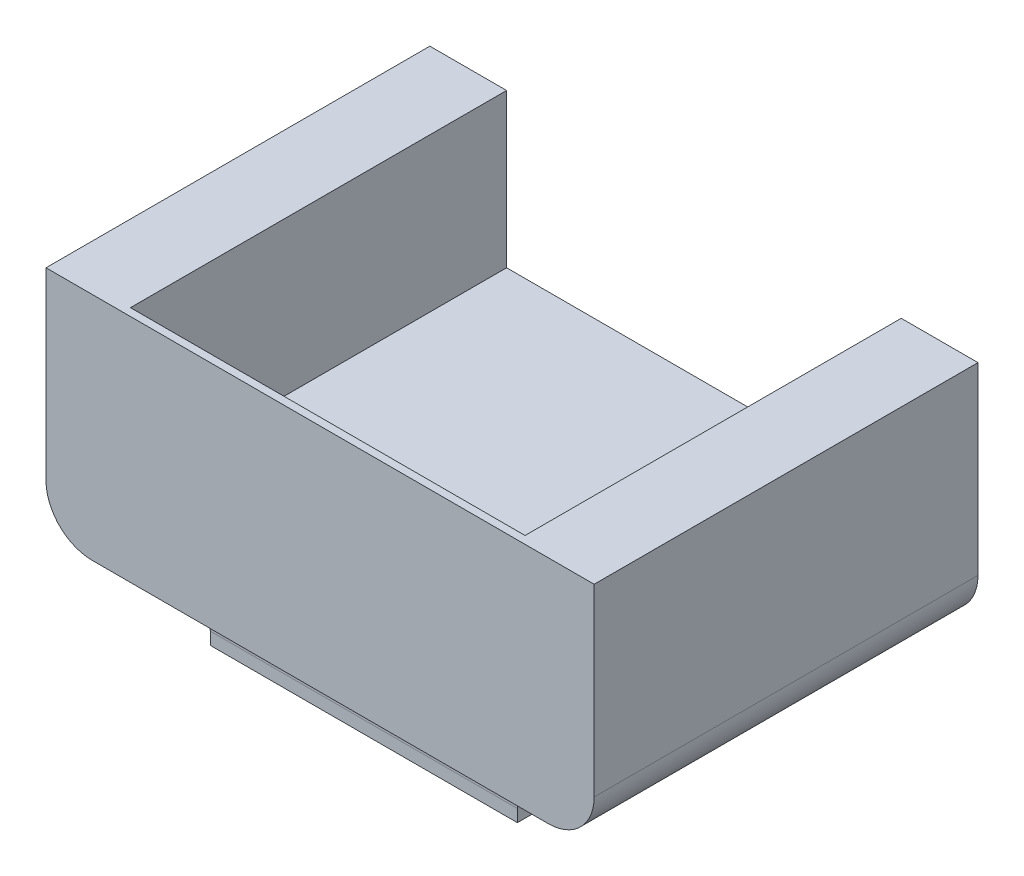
ISO-10303-21;
HEADER;
FILE_DESCRIPTION(('STEP AP214'),'2;1');
FILE_NAME('part.step','',(''),(''),'','','');
FILE_SCHEMA(('AUTOMOTIVE_DESIGN { 1 0 10303 214 1 1 1 1 }'));
ENDSEC;
DATA;
#1=APPLICATION_CONTEXT('core data for automotive mechanical design processes');
#2=APPLICATION_PROTOCOL_DEFINITION('international standard','automotive_design',2000,#1);
#3=PRODUCT_CONTEXT('',#1,'mechanical');
#4=PRODUCT('Part','Part','',(#3));
#5=PRODUCT_RELATED_PRODUCT_CATEGORY('part','',(#4));
#6=PRODUCT_DEFINITION_FORMATION('','',#4);
#7=PRODUCT_DEFINITION_CONTEXT('part definition',#1,'design');
#8=PRODUCT_DEFINITION('design','',#6,#7);
#9=PRODUCT_DEFINITION_SHAPE('','',#8);
#10=(LENGTH_UNIT() NAMED_UNIT(*) SI_UNIT(.MILLI.,.METRE.));
#11=(NAMED_UNIT(*) PLANE_ANGLE_UNIT() SI_UNIT($,.RADIAN.));
#12=(NAMED_UNIT(*) SI_UNIT($,.STERADIAN.) SOLID_ANGLE_UNIT());
#13=UNCERTAINTY_MEASURE_WITH_UNIT(LENGTH_MEASURE(1.E-05),#10,'distance_accuracy_value','');
#14=(GEOMETRIC_REPRESENTATION_CONTEXT(3) GLOBAL_UNCERTAINTY_ASSIGNED_CONTEXT((#13)) GLOBAL_UNIT_ASSIGNED_CONTEXT((#10,
#11,#12)) REPRESENTATION_CONTEXT('',''));
#15=CARTESIAN_POINT('',(0.,0.,0.));
#16=DIRECTION('',(0.,0.,1.));
#17=DIRECTION('',(1.,0.,0.));
#18=AXIS2_PLACEMENT_3D('',#15,#16,#17);
#19=CARTESIAN_POINT('',(17.8500000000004,62.3776420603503,-25.));
#20=DIRECTION('',(0.,-1.,0.));
#21=DIRECTION('',(1.,0.,0.));
#22=AXIS2_PLACEMENT_3D('',#19,#20,#21);
#23=PLANE('',#22);
#24=DIRECTION('',(-1.,0.,0.));
#25=VECTOR('',#24,1.);
#26=CARTESIAN_POINT('',(17.8500000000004,62.3776420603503,-19.9699999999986));
#27=LINE('',#26,#25);
#28=CARTESIAN_POINT('',(10.,62.3776420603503,-19.9699999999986));
#29=VERTEX_POINT('',#28);
#30=CARTESIAN_POINT('',(-10.,62.3776420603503,-19.9699999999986));
#31=VERTEX_POINT('',#30);
#32=EDGE_CURVE('E224',#29,#31,#27,.T.);
#33=ORIENTED_EDGE('',*,*,#32,.T.);
#34=DIRECTION('',(0.,0.,1.));
#35=VECTOR('',#34,1.);
#36=CARTESIAN_POINT('',(-10.,62.3776420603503,-16.9699999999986));
#37=LINE('',#36,#35);
#38=CARTESIAN_POINT('',(-10.,62.3776420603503,-14.9699999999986));
#39=VERTEX_POINT('',#38);
#40=EDGE_CURVE('E385',#31,#39,#37,.T.);
#41=ORIENTED_EDGE('',*,*,#40,.T.);
#42=DIRECTION('',(-1.,0.,0.));
#43=VECTOR('',#42,1.);
#44=CARTESIAN_POINT('',(10.,62.3776420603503,-14.9699999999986));
#45=LINE('',#44,#43);
#46=CARTESIAN_POINT('',(10.,62.3776420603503,-14.9699999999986));
#47=VERTEX_POINT('',#46);
#48=EDGE_CURVE('E375',#47,#39,#45,.T.);
#49=ORIENTED_EDGE('',*,*,#48,.F.);
#50=DIRECTION('',(0.,0.,1.));
#51=VECTOR('',#50,1.);
#52=CARTESIAN_POINT('',(10.,62.3776420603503,-16.9699999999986));
#53=LINE('',#52,#51);
#54=EDGE_CURVE('E395',#29,#47,#53,.T.);
#55=ORIENTED_EDGE('',*,*,#54,.F.);
#56=EDGE_LOOP('',(#33,#41,#49,#55));
#57=FACE_BOUND('',#56,.T.);
#58=DIRECTION('',(1.,0.,0.));
#59=VECTOR('',#58,1.);
#60=CARTESIAN_POINT('',(17.8500000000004,62.3776420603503,-25.));
#61=LINE('',#60,#59);
#62=CARTESIAN_POINT('',(-14.8499999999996,62.3776420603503,-25.));
#63=VERTEX_POINT('',#62);
#64=CARTESIAN_POINT('',(14.8500000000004,62.3776420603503,-25.));
#65=VERTEX_POINT('',#64);
#66=EDGE_CURVE('E286',#63,#65,#61,.T.);
#67=ORIENTED_EDGE('',*,*,#66,.T.);
#68=DIRECTION('',(0.,0.,1.));
#69=VECTOR('',#68,1.);
#70=CARTESIAN_POINT('',(14.8500000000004,62.3776420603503,-25.));
#71=LINE('',#70,#69);
#72=CARTESIAN_POINT('',(14.8500000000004,62.3776420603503,0.));
#73=VERTEX_POINT('',#72);
#74=EDGE_CURVE('E230',#65,#73,#71,.T.);
#75=ORIENTED_EDGE('',*,*,#74,.T.);
#76=DIRECTION('',(1.,0.,0.));
#77=VECTOR('',#76,1.);
#78=CARTESIAN_POINT('',(17.8500000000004,62.3776420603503,0.));
#79=LINE('',#78,#77);
#80=CARTESIAN_POINT('',(10.,62.3776420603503,0.));
#81=VERTEX_POINT('',#80);
#82=EDGE_CURVE('E275',#81,#73,#79,.T.);
#83=ORIENTED_EDGE('',*,*,#82,.F.);
#84=DIRECTION('',(0.,0.,1.));
#85=VECTOR('',#84,1.);
#86=CARTESIAN_POINT('',(10.,62.3776420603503,-4.84999999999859));
#87=LINE('',#86,#85);
#88=CARTESIAN_POINT('',(10.,62.3776420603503,-4.84999999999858));
#89=VERTEX_POINT('',#88);
#90=EDGE_CURVE('E366',#89,#81,#87,.T.);
#91=ORIENTED_EDGE('',*,*,#90,.F.);
#92=DIRECTION('',(-1.,0.,0.));
#93=VECTOR('',#92,1.);
#94=CARTESIAN_POINT('',(10.,62.3776420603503,-4.84999999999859));
#95=LINE('',#94,#93);
#96=CARTESIAN_POINT('',(-10.,62.3776420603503,-4.84999999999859));
#97=VERTEX_POINT('',#96);
#98=EDGE_CURVE('E349',#89,#97,#95,.T.);
#99=ORIENTED_EDGE('',*,*,#98,.T.);
#100=DIRECTION('',(0.,0.,1.));
#101=VECTOR('',#100,1.);
#102=CARTESIAN_POINT('',(-10.,62.3776420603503,-4.84999999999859));
#103=LINE('',#102,#101);
#104=CARTESIAN_POINT('',(-10.,62.3776420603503,0.));
#105=VERTEX_POINT('',#104);
#106=EDGE_CURVE('E260',#97,#105,#103,.T.);
#107=ORIENTED_EDGE('',*,*,#106,.T.);
#108=CARTESIAN_POINT('',(-14.8499999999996,62.3776420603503,0.));
#109=VERTEX_POINT('',#108);
#110=EDGE_CURVE('E265',#109,#105,#79,.T.);
#111=ORIENTED_EDGE('',*,*,#110,.F.);
#112=DIRECTION('',(0.,0.,1.));
#113=VECTOR('',#112,1.);
#114=CARTESIAN_POINT('',(-14.8499999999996,62.3776420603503,-25.));
#115=LINE('',#114,#113);
#116=EDGE_CURVE('E227',#109,#63,#115,.F.);
#117=ORIENTED_EDGE('',*,*,#116,.T.);
#118=EDGE_LOOP('',(#67,#75,#83,#91,#99,#107,#111,#117));
#119=FACE_BOUND('',#118,.T.);
#120=DIRECTION('',(0.,0.,1.));
#121=VECTOR('',#120,1.);
#122=CARTESIAN_POINT('',(10.,62.3776420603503,-13.6499999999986));
#123=LINE('',#122,#121);
#124=CARTESIAN_POINT('',(10.,62.3776420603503,-13.6499999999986));
#125=VERTEX_POINT('',#124);
#126=CARTESIAN_POINT('',(10.,62.3776420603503,-6.16999999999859));
#127=VERTEX_POINT('',#126);
#128=EDGE_CURVE('E327',#125,#127,#123,.T.);
#129=ORIENTED_EDGE('',*,*,#128,.F.);
#130=DIRECTION('',(-1.,0.,0.));
#131=VECTOR('',#130,1.);
#132=CARTESIAN_POINT('',(10.,62.3776420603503,-13.6499999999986));
#133=LINE('',#132,#131);
#134=CARTESIAN_POINT('',(-10.,62.3776420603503,-13.6499999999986));
#135=VERTEX_POINT('',#134);
#136=EDGE_CURVE('E321',#125,#135,#133,.T.);
#137=ORIENTED_EDGE('',*,*,#136,.T.);
#138=DIRECTION('',(0.,0.,1.));
#139=VECTOR('',#138,1.);
#140=CARTESIAN_POINT('',(-10.,62.3776420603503,-13.6499999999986));
#141=LINE('',#140,#139);
#142=CARTESIAN_POINT('',(-10.,62.3776420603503,-6.16999999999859));
#143=VERTEX_POINT('',#142);
#144=EDGE_CURVE('E328',#135,#143,#141,.T.);
#145=ORIENTED_EDGE('',*,*,#144,.T.);
#146=DIRECTION('',(-1.,0.,0.));
#147=VECTOR('',#146,1.);
#148=CARTESIAN_POINT('',(10.,62.3776420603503,-6.16999999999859));
#149=LINE('',#148,#147);
#150=EDGE_CURVE('E324',#127,#143,#149,.T.);
#151=ORIENTED_EDGE('',*,*,#150,.F.);
#152=EDGE_LOOP('',(#129,#137,#145,#151));
#153=FACE_BOUND('',#152,.T.);
#154=ADVANCED_FACE('F31',(#57,#119,#153),#23,.T.);
#155=CARTESIAN_POINT('',(-17.8499999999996,62.3776420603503,-25.));
#156=DIRECTION('',(-1.,0.,0.));
#157=DIRECTION('',(0.,-1.,0.));
#158=AXIS2_PLACEMENT_3D('',#155,#156,#157);
#159=PLANE('',#158);
#160=DIRECTION('',(0.,-1.,0.));
#161=VECTOR('',#160,1.);
#162=CARTESIAN_POINT('',(-17.8499999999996,62.3776420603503,-25.));
#163=LINE('',#162,#161);
#164=CARTESIAN_POINT('',(-17.8499999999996,77.3776420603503,-25.));
#165=VERTEX_POINT('',#164);
#166=CARTESIAN_POINT('',(-17.8499999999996,65.3776420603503,-25.));
#167=VERTEX_POINT('',#166);
#168=EDGE_CURVE('E223',#165,#167,#163,.T.);
#169=ORIENTED_EDGE('',*,*,#168,.T.);
#170=DIRECTION('',(0.,0.,1.));
#171=VECTOR('',#170,1.);
#172=CARTESIAN_POINT('',(-17.8499999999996,65.3776420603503,-25.));
#173=LINE('',#172,#171);
#174=CARTESIAN_POINT('',(-17.8499999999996,65.3776420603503,0.));
#175=VERTEX_POINT('',#174);
#176=EDGE_CURVE('E243',#167,#175,#173,.T.);
#177=ORIENTED_EDGE('',*,*,#176,.T.);
#178=DIRECTION('',(0.,-1.,0.));
#179=VECTOR('',#178,1.);
#180=CARTESIAN_POINT('',(-17.8499999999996,62.3776420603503,0.));
#181=LINE('',#180,#179);
#182=CARTESIAN_POINT('',(-17.8499999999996,77.3776420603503,0.));
#183=VERTEX_POINT('',#182);
#184=EDGE_CURVE('E284',#183,#175,#181,.T.);
#185=ORIENTED_EDGE('',*,*,#184,.F.);
#186=DIRECTION('',(0.,0.,1.));
#187=VECTOR('',#186,1.);
#188=CARTESIAN_POINT('',(-17.8499999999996,77.3776420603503,-25.));
#189=LINE('',#188,#187);
#190=EDGE_CURVE('E228',#165,#183,#189,.T.);
#191=ORIENTED_EDGE('',*,*,#190,.F.);
#192=EDGE_LOOP('',(#169,#177,#185,#191));
#193=FACE_BOUND('',#192,.T.);
#194=ADVANCED_FACE('F439',(#193),#159,.T.);
#195=CARTESIAN_POINT('',(-12.8499999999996,77.3776420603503,-25.));
#196=DIRECTION('',(0.,1.,0.));
#197=DIRECTION('',(0.,0.,1.));
#198=AXIS2_PLACEMENT_3D('',#195,#196,#197);
#199=PLANE('',#198);
#200=DIRECTION('',(-1.,0.,0.));
#201=VECTOR('',#200,1.);
#202=CARTESIAN_POINT('',(-12.8499999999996,77.3776420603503,0.));
#203=LINE('',#202,#201);
#204=CARTESIAN_POINT('',(17.8500000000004,77.3776420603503,0.));
#205=VERTEX_POINT('',#204);
#206=EDGE_CURVE('E281',#205,#183,#203,.T.);
#207=ORIENTED_EDGE('',*,*,#206,.F.);
#208=DIRECTION('',(0.,0.,1.));
#209=VECTOR('',#208,1.);
#210=CARTESIAN_POINT('',(17.8500000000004,77.3776420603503,-25.));
#211=LINE('',#210,#209);
#212=CARTESIAN_POINT('',(17.8500000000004,77.3776420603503,-25.));
#213=VERTEX_POINT('',#212);
#214=EDGE_CURVE('E217',#213,#205,#211,.T.);
#215=ORIENTED_EDGE('',*,*,#214,.F.);
#216=DIRECTION('',(-1.,0.,0.));
#217=VECTOR('',#216,1.);
#218=CARTESIAN_POINT('',(12.8500000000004,77.3776420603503,-25.));
#219=LINE('',#218,#217);
#220=CARTESIAN_POINT('',(12.8500000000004,77.3776420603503,-25.));
#221=VERTEX_POINT('',#220);
#222=EDGE_CURVE('E309',#213,#221,#219,.T.);
#223=ORIENTED_EDGE('',*,*,#222,.T.);
#224=DIRECTION('',(0.,0.,1.));
#225=VECTOR('',#224,1.);
#226=CARTESIAN_POINT('',(12.8500000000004,77.3776420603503,-25.));
#227=LINE('',#226,#225);
#228=CARTESIAN_POINT('',(12.8500000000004,77.3776420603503,-0.5));
#229=VERTEX_POINT('',#228);
#230=EDGE_CURVE('E213',#221,#229,#227,.T.);
#231=ORIENTED_EDGE('',*,*,#230,.T.);
#232=DIRECTION('',(-1.,0.,0.));
#233=VECTOR('',#232,1.);
#234=CARTESIAN_POINT('',(12.8500000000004,77.3776420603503,-0.5));
#235=LINE('',#234,#233);
#236=CARTESIAN_POINT('',(-12.8499999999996,77.3776420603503,-0.5));
#237=VERTEX_POINT('',#236);
#238=EDGE_CURVE('E196',#229,#237,#235,.T.);
#239=ORIENTED_EDGE('',*,*,#238,.T.);
#240=DIRECTION('',(0.,0.,1.));
#241=VECTOR('',#240,1.);
#242=CARTESIAN_POINT('',(-12.8499999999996,77.3776420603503,-25.));
#243=LINE('',#242,#241);
#244=CARTESIAN_POINT('',(-12.8499999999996,77.3776420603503,-25.));
#245=VERTEX_POINT('',#244);
#246=EDGE_CURVE('E215',#245,#237,#243,.T.);
#247=ORIENTED_EDGE('',*,*,#246,.F.);
#248=DIRECTION('',(-1.,0.,0.));
#249=VECTOR('',#248,1.);
#250=CARTESIAN_POINT('',(-12.8499999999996,77.3776420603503,-25.));
#251=LINE('',#250,#249);
#252=EDGE_CURVE('E298',#245,#165,#251,.T.);
#253=ORIENTED_EDGE('',*,*,#252,.T.);
#254=ORIENTED_EDGE('',*,*,#190,.T.);
#255=EDGE_LOOP('',(#207,#215,#223,#231,#239,#247,#253,#254));
#256=FACE_BOUND('',#255,.T.);
#257=ADVANCED_FACE('F297',(#256),#199,.T.);
#258=CARTESIAN_POINT('',(-12.8499999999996,67.3776420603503,-25.));
#259=DIRECTION('',(1.,0.,0.));
#260=DIRECTION('',(0.,1.,0.));
#261=AXIS2_PLACEMENT_3D('',#258,#259,#260);
#262=PLANE('',#261);
#263=DIRECTION('',(0.,-1.,0.));
#264=VECTOR('',#263,1.);
#265=CARTESIAN_POINT('',(-12.8499999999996,67.3776420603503,-0.5));
#266=LINE('',#265,#264);
#267=CARTESIAN_POINT('',(-12.8499999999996,67.3776420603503,-0.5));
#268=VERTEX_POINT('',#267);
#269=EDGE_CURVE('E291',#237,#268,#266,.T.);
#270=ORIENTED_EDGE('',*,*,#269,.T.);
#271=DIRECTION('',(0.,0.,1.));
#272=VECTOR('',#271,1.);
#273=CARTESIAN_POINT('',(-12.8499999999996,67.3776420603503,-25.));
#274=LINE('',#273,#272);
#275=CARTESIAN_POINT('',(-12.8499999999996,67.3776420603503,-25.));
#276=VERTEX_POINT('',#275);
#277=EDGE_CURVE('E207',#276,#268,#274,.T.);
#278=ORIENTED_EDGE('',*,*,#277,.F.);
#279=DIRECTION('',(0.,1.,0.));
#280=VECTOR('',#279,1.);
#281=CARTESIAN_POINT('',(-12.8499999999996,67.3776420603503,-25.));
#282=LINE('',#281,#280);
#283=EDGE_CURVE('E293',#276,#245,#282,.T.);
#284=ORIENTED_EDGE('',*,*,#283,.T.);
#285=ORIENTED_EDGE('',*,*,#246,.T.);
#286=EDGE_LOOP('',(#270,#278,#284,#285));
#287=FACE_BOUND('',#286,.T.);
#288=ADVANCED_FACE('F290',(#287),#262,.T.);
#289=CARTESIAN_POINT('',(12.8500000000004,67.3776420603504,-25.));
#290=DIRECTION('',(0.,1.,0.));
#291=DIRECTION('',(-1.,0.,0.));
#292=AXIS2_PLACEMENT_3D('',#289,#290,#291);
#293=PLANE('',#292);
#294=DIRECTION('',(1.,0.,0.));
#295=VECTOR('',#294,1.);
#296=CARTESIAN_POINT('',(12.8500000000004,67.3776420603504,-0.5));
#297=LINE('',#296,#295);
#298=CARTESIAN_POINT('',(12.8500000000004,67.3776420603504,-0.5));
#299=VERTEX_POINT('',#298);
#300=EDGE_CURVE('E194',#268,#299,#297,.T.);
#301=ORIENTED_EDGE('',*,*,#300,.T.);
#302=DIRECTION('',(0.,0.,1.));
#303=VECTOR('',#302,1.);
#304=CARTESIAN_POINT('',(12.8500000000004,67.3776420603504,-25.));
#305=LINE('',#304,#303);
#306=CARTESIAN_POINT('',(12.8500000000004,67.3776420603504,-25.));
#307=VERTEX_POINT('',#306);
#308=EDGE_CURVE('E205',#307,#299,#305,.T.);
#309=ORIENTED_EDGE('',*,*,#308,.F.);
#310=DIRECTION('',(-1.,0.,0.));
#311=VECTOR('',#310,1.);
#312=CARTESIAN_POINT('',(12.8500000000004,67.3776420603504,-25.));
#313=LINE('',#312,#311);
#314=EDGE_CURVE('E304',#307,#276,#313,.T.);
#315=ORIENTED_EDGE('',*,*,#314,.T.);
#316=ORIENTED_EDGE('',*,*,#277,.T.);
#317=EDGE_LOOP('',(#301,#309,#315,#316));
#318=FACE_BOUND('',#317,.T.);
#319=ADVANCED_FACE('F203',(#318),#293,.T.);
#320=CARTESIAN_POINT('',(12.8500000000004,67.3776420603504,-25.));
#321=DIRECTION('',(-1.,0.,0.));
#322=DIRECTION('',(0.,-1.,0.));
#323=AXIS2_PLACEMENT_3D('',#320,#321,#322);
#324=PLANE('',#323);
#325=DIRECTION('',(0.,1.,0.));
#326=VECTOR('',#325,1.);
#327=CARTESIAN_POINT('',(12.8500000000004,77.3776420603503,-0.5));
#328=LINE('',#327,#326);
#329=EDGE_CURVE('E190',#299,#229,#328,.T.);
#330=ORIENTED_EDGE('',*,*,#329,.T.);
#331=ORIENTED_EDGE('',*,*,#230,.F.);
#332=DIRECTION('',(0.,-1.,0.));
#333=VECTOR('',#332,1.);
#334=CARTESIAN_POINT('',(12.8500000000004,67.3776420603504,-25.));
#335=LINE('',#334,#333);
#336=EDGE_CURVE('E212',#221,#307,#335,.T.);
#337=ORIENTED_EDGE('',*,*,#336,.T.);
#338=ORIENTED_EDGE('',*,*,#308,.T.);
#339=EDGE_LOOP('',(#330,#331,#337,#338));
#340=FACE_BOUND('',#339,.T.);
#341=ADVANCED_FACE('F210',(#340),#324,.T.);
#342=CARTESIAN_POINT('',(17.8500000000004,62.3776420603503,-25.));
#343=DIRECTION('',(1.,0.,0.));
#344=DIRECTION('',(0.,0.,-1.));
#345=AXIS2_PLACEMENT_3D('',#342,#343,#344);
#346=PLANE('',#345);
#347=DIRECTION('',(0.,1.,0.));
#348=VECTOR('',#347,1.);
#349=CARTESIAN_POINT('',(17.8500000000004,62.3776420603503,0.));
#350=LINE('',#349,#348);
#351=CARTESIAN_POINT('',(17.8500000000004,65.3776420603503,0.));
#352=VERTEX_POINT('',#351);
#353=EDGE_CURVE('E273',#352,#205,#350,.T.);
#354=ORIENTED_EDGE('',*,*,#353,.F.);
#355=DIRECTION('',(0.,0.,1.));
#356=VECTOR('',#355,1.);
#357=CARTESIAN_POINT('',(17.8500000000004,65.3776420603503,-25.));
#358=LINE('',#357,#356);
#359=CARTESIAN_POINT('',(17.8500000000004,65.3776420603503,-25.));
#360=VERTEX_POINT('',#359);
#361=EDGE_CURVE('E237',#352,#360,#358,.F.);
#362=ORIENTED_EDGE('',*,*,#361,.T.);
#363=DIRECTION('',(0.,1.,0.));
#364=VECTOR('',#363,1.);
#365=CARTESIAN_POINT('',(17.8500000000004,62.3776420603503,-25.));
#366=LINE('',#365,#364);
#367=EDGE_CURVE('E312',#360,#213,#366,.T.);
#368=ORIENTED_EDGE('',*,*,#367,.T.);
#369=ORIENTED_EDGE('',*,*,#214,.T.);
#370=EDGE_LOOP('',(#354,#362,#368,#369));
#371=FACE_BOUND('',#370,.T.);
#372=ADVANCED_FACE('F447',(#371),#346,.T.);
#373=CARTESIAN_POINT('',(-17.8499999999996,62.3776420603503,-25.));
#374=DIRECTION('',(0.,0.,-1.));
#375=DIRECTION('',(-1.,0.,0.));
#376=AXIS2_PLACEMENT_3D('',#373,#374,#375);
#377=PLANE('',#376);
#378=ORIENTED_EDGE('',*,*,#367,.F.);
#379=CARTESIAN_POINT('',(14.8500000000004,65.3776420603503,-25.));
#380=DIRECTION('',(0.,0.,-1.));
#381=DIRECTION('',(-1.,0.,0.));
#382=AXIS2_PLACEMENT_3D('',#379,#380,#381);
#383=CIRCLE('',#382,3.);
#384=EDGE_CURVE('E241',#360,#65,#383,.T.);
#385=ORIENTED_EDGE('',*,*,#384,.T.);
#386=ORIENTED_EDGE('',*,*,#66,.F.);
#387=CARTESIAN_POINT('',(-14.8499999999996,65.3776420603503,-25.));
#388=DIRECTION('',(0.,0.,-1.));
#389=DIRECTION('',(-1.,0.,0.));
#390=AXIS2_PLACEMENT_3D('',#387,#388,#389);
#391=CIRCLE('',#390,3.);
#392=EDGE_CURVE('E239',#63,#167,#391,.T.);
#393=ORIENTED_EDGE('',*,*,#392,.T.);
#394=ORIENTED_EDGE('',*,*,#168,.F.);
#395=ORIENTED_EDGE('',*,*,#252,.F.);
#396=ORIENTED_EDGE('',*,*,#283,.F.);
#397=ORIENTED_EDGE('',*,*,#314,.F.);
#398=ORIENTED_EDGE('',*,*,#336,.F.);
#399=ORIENTED_EDGE('',*,*,#222,.F.);
#400=EDGE_LOOP('',(#378,#385,#386,#393,#394,#395,#396,#397,#398,#399));
#401=FACE_BOUND('',#400,.T.);
#402=ADVANCED_FACE('F302',(#401),#377,.T.);
#403=CARTESIAN_POINT('',(-17.8499999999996,62.3776420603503,0.));
#404=DIRECTION('',(0.,0.,-1.));
#405=DIRECTION('',(-1.,0.,0.));
#406=AXIS2_PLACEMENT_3D('',#403,#404,#405);
#407=PLANE('',#406);
#408=ORIENTED_EDGE('',*,*,#353,.T.);
#409=ORIENTED_EDGE('',*,*,#206,.T.);
#410=ORIENTED_EDGE('',*,*,#184,.T.);
#411=CARTESIAN_POINT('',(-14.8499999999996,65.3776420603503,0.));
#412=DIRECTION('',(0.,0.,-1.));
#413=DIRECTION('',(-1.,0.,0.));
#414=AXIS2_PLACEMENT_3D('',#411,#412,#413);
#415=CIRCLE('',#414,3.);
#416=EDGE_CURVE('E233',#175,#109,#415,.F.);
#417=ORIENTED_EDGE('',*,*,#416,.T.);
#418=ORIENTED_EDGE('',*,*,#110,.T.);
#419=EDGE_CURVE('E269',#105,#81,#79,.T.);
#420=ORIENTED_EDGE('',*,*,#419,.T.);
#421=ORIENTED_EDGE('',*,*,#82,.T.);
#422=CARTESIAN_POINT('',(14.8500000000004,65.3776420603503,0.));
#423=DIRECTION('',(0.,0.,-1.));
#424=DIRECTION('',(-1.,0.,0.));
#425=AXIS2_PLACEMENT_3D('',#422,#423,#424);
#426=CIRCLE('',#425,3.);
#427=EDGE_CURVE('E235',#73,#352,#426,.F.);
#428=ORIENTED_EDGE('',*,*,#427,.T.);
#429=EDGE_LOOP('',(#408,#409,#410,#417,#418,#420,#421,#428));
#430=FACE_BOUND('',#429,.T.);
#431=ADVANCED_FACE('F267',(#430),#407,.F.);
#432=CARTESIAN_POINT('',(10.,59.7776420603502,-6.16999999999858));
#433=DIRECTION('',(0.,0.,-1.));
#434=DIRECTION('',(0.,1.,0.));
#435=AXIS2_PLACEMENT_3D('',#432,#433,#434);
#436=PLANE('',#435);
#437=DIRECTION('',(0.,-1.,0.));
#438=VECTOR('',#437,1.);
#439=CARTESIAN_POINT('',(-10.,59.7776420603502,-6.16999999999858));
#440=LINE('',#439,#438);
#441=CARTESIAN_POINT('',(-10.,59.7776420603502,-6.16999999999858));
#442=VERTEX_POINT('',#441);
#443=EDGE_CURVE('E336',#143,#442,#440,.T.);
#444=ORIENTED_EDGE('',*,*,#443,.T.);
#445=DIRECTION('',(-1.,0.,0.));
#446=VECTOR('',#445,1.);
#447=CARTESIAN_POINT('',(10.,59.7776420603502,-6.16999999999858));
#448=LINE('',#447,#446);
#449=CARTESIAN_POINT('',(10.,59.7776420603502,-6.16999999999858));
#450=VERTEX_POINT('',#449);
#451=EDGE_CURVE('E276',#450,#442,#448,.T.);
#452=ORIENTED_EDGE('',*,*,#451,.F.);
#453=DIRECTION('',(0.,-1.,0.));
#454=VECTOR('',#453,1.);
#455=CARTESIAN_POINT('',(10.,59.7776420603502,-6.16999999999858));
#456=LINE('',#455,#454);
#457=EDGE_CURVE('E331',#127,#450,#456,.T.);
#458=ORIENTED_EDGE('',*,*,#457,.F.);
#459=ORIENTED_EDGE('',*,*,#150,.T.);
#460=EDGE_LOOP('',(#444,#452,#458,#459));
#461=FACE_BOUND('',#460,.T.);
#462=ADVANCED_FACE('F471',(#461),#436,.F.);
#463=CARTESIAN_POINT('',(10.,59.7776420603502,-13.6499999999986));
#464=DIRECTION('',(0.,1.,0.));
#465=DIRECTION('',(0.,0.,1.));
#466=AXIS2_PLACEMENT_3D('',#463,#464,#465);
#467=PLANE('',#466);
#468=DIRECTION('',(0.,0.,-1.));
#469=VECTOR('',#468,1.);
#470=CARTESIAN_POINT('',(-10.,59.7776420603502,-13.6499999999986));
#471=LINE('',#470,#469);
#472=CARTESIAN_POINT('',(-10.,59.7776420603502,-13.6499999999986));
#473=VERTEX_POINT('',#472);
#474=EDGE_CURVE('E334',#442,#473,#471,.T.);
#475=ORIENTED_EDGE('',*,*,#474,.T.);
#476=DIRECTION('',(-1.,0.,0.));
#477=VECTOR('',#476,1.);
#478=CARTESIAN_POINT('',(10.,59.7776420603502,-13.6499999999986));
#479=LINE('',#478,#477);
#480=CARTESIAN_POINT('',(10.,59.7776420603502,-13.6499999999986));
#481=VERTEX_POINT('',#480);
#482=EDGE_CURVE('E318',#481,#473,#479,.T.);
#483=ORIENTED_EDGE('',*,*,#482,.F.);
#484=DIRECTION('',(0.,0.,-1.));
#485=VECTOR('',#484,1.);
#486=CARTESIAN_POINT('',(10.,59.7776420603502,-13.6499999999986));
#487=LINE('',#486,#485);
#488=EDGE_CURVE('E343',#450,#481,#487,.T.);
#489=ORIENTED_EDGE('',*,*,#488,.F.);
#490=ORIENTED_EDGE('',*,*,#451,.T.);
#491=EDGE_LOOP('',(#475,#483,#489,#490));
#492=FACE_BOUND('',#491,.T.);
#493=ADVANCED_FACE('F663',(#492),#467,.F.);
#494=CARTESIAN_POINT('',(10.,62.3776420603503,-13.6499999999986));
#495=DIRECTION('',(0.,0.,1.));
#496=DIRECTION('',(0.,-1.,0.));
#497=AXIS2_PLACEMENT_3D('',#494,#495,#496);
#498=PLANE('',#497);
#499=DIRECTION('',(0.,1.,0.));
#500=VECTOR('',#499,1.);
#501=CARTESIAN_POINT('',(-10.,62.3776420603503,-13.6499999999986));
#502=LINE('',#501,#500);
#503=EDGE_CURVE('E332',#473,#135,#502,.T.);
#504=ORIENTED_EDGE('',*,*,#503,.T.);
#505=ORIENTED_EDGE('',*,*,#136,.F.);
#506=DIRECTION('',(0.,1.,0.));
#507=VECTOR('',#506,1.);
#508=CARTESIAN_POINT('',(10.,62.3776420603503,-13.6499999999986));
#509=LINE('',#508,#507);
#510=EDGE_CURVE('E341',#481,#125,#509,.T.);
#511=ORIENTED_EDGE('',*,*,#510,.F.);
#512=ORIENTED_EDGE('',*,*,#482,.T.);
#513=EDGE_LOOP('',(#504,#505,#511,#512));
#514=FACE_BOUND('',#513,.T.);
#515=ADVANCED_FACE('F653',(#514),#498,.F.);
#516=CARTESIAN_POINT('',(10.,62.3776420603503,-6.16999999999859));
#517=DIRECTION('',(1.,0.,0.));
#518=DIRECTION('',(0.,0.,-1.));
#519=AXIS2_PLACEMENT_3D('',#516,#517,#518);
#520=PLANE('',#519);
#521=ORIENTED_EDGE('',*,*,#457,.T.);
#522=ORIENTED_EDGE('',*,*,#488,.T.);
#523=ORIENTED_EDGE('',*,*,#510,.T.);
#524=ORIENTED_EDGE('',*,*,#128,.T.);
#525=EDGE_LOOP('',(#521,#522,#523,#524));
#526=FACE_BOUND('',#525,.T.);
#527=ADVANCED_FACE('F643',(#526),#520,.T.);
#528=CARTESIAN_POINT('',(-10.,62.3776420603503,-6.16999999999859));
#529=DIRECTION('',(1.,0.,0.));
#530=DIRECTION('',(0.,0.,-1.));
#531=AXIS2_PLACEMENT_3D('',#528,#529,#530);
#532=PLANE('',#531);
#533=ORIENTED_EDGE('',*,*,#443,.F.);
#534=ORIENTED_EDGE('',*,*,#144,.F.);
#535=ORIENTED_EDGE('',*,*,#503,.F.);
#536=ORIENTED_EDGE('',*,*,#474,.F.);
#537=EDGE_LOOP('',(#533,#534,#535,#536));
#538=FACE_BOUND('',#537,.T.);
#539=ADVANCED_FACE('F633',(#538),#532,.F.);
#540=CARTESIAN_POINT('',(10.,58.5776420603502,-4.84999999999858));
#541=DIRECTION('',(0.,1.,0.));
#542=DIRECTION('',(0.,0.,1.));
#543=AXIS2_PLACEMENT_3D('',#540,#541,#542);
#544=PLANE('',#543);
#545=DIRECTION('',(0.,0.,-1.));
#546=VECTOR('',#545,1.);
#547=CARTESIAN_POINT('',(-10.,58.5776420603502,-4.84999999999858));
#548=LINE('',#547,#546);
#549=CARTESIAN_POINT('',(-10.,58.5776420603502,-2.84999999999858));
#550=VERTEX_POINT('',#549);
#551=CARTESIAN_POINT('',(-10.,58.5776420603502,-4.84999999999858));
#552=VERTEX_POINT('',#551);
#553=EDGE_CURVE('E361',#550,#552,#548,.T.);
#554=ORIENTED_EDGE('',*,*,#553,.T.);
#555=DIRECTION('',(-1.,0.,0.));
#556=VECTOR('',#555,1.);
#557=CARTESIAN_POINT('',(10.,58.5776420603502,-4.84999999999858));
#558=LINE('',#557,#556);
#559=CARTESIAN_POINT('',(10.,58.5776420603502,-4.84999999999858));
#560=VERTEX_POINT('',#559);
#561=EDGE_CURVE('E339',#560,#552,#558,.T.);
#562=ORIENTED_EDGE('',*,*,#561,.F.);
#563=DIRECTION('',(0.,0.,-1.));
#564=VECTOR('',#563,1.);
#565=CARTESIAN_POINT('',(10.,58.5776420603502,-4.84999999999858));
#566=LINE('',#565,#564);
#567=CARTESIAN_POINT('',(10.,58.5776420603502,-2.84999999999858));
#568=VERTEX_POINT('',#567);
#569=EDGE_CURVE('E356',#568,#560,#566,.T.);
#570=ORIENTED_EDGE('',*,*,#569,.F.);
#571=DIRECTION('',(-1.,0.,0.));
#572=VECTOR('',#571,1.);
#573=CARTESIAN_POINT('',(10.,58.5776420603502,-2.84999999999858));
#574=LINE('',#573,#572);
#575=EDGE_CURVE('E351',#568,#550,#574,.T.);
#576=ORIENTED_EDGE('',*,*,#575,.T.);
#577=EDGE_LOOP('',(#554,#562,#570,#576));
#578=FACE_BOUND('',#577,.T.);
#579=ADVANCED_FACE('F623',(#578),#544,.F.);
#580=CARTESIAN_POINT('',(10.,62.3776420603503,-4.84999999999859));
#581=DIRECTION('',(0.,0.,1.));
#582=DIRECTION('',(0.,-1.,0.));
#583=AXIS2_PLACEMENT_3D('',#580,#581,#582);
#584=PLANE('',#583);
#585=DIRECTION('',(0.,1.,0.));
#586=VECTOR('',#585,1.);
#587=CARTESIAN_POINT('',(-10.,62.3776420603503,-4.84999999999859));
#588=LINE('',#587,#586);
#589=EDGE_CURVE('E358',#552,#97,#588,.T.);
#590=ORIENTED_EDGE('',*,*,#589,.T.);
#591=ORIENTED_EDGE('',*,*,#98,.F.);
#592=DIRECTION('',(0.,1.,0.));
#593=VECTOR('',#592,1.);
#594=CARTESIAN_POINT('',(10.,62.3776420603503,-4.84999999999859));
#595=LINE('',#594,#593);
#596=EDGE_CURVE('E368',#560,#89,#595,.T.);
#597=ORIENTED_EDGE('',*,*,#596,.F.);
#598=ORIENTED_EDGE('',*,*,#561,.T.);
#599=EDGE_LOOP('',(#590,#591,#597,#598));
#600=FACE_BOUND('',#599,.T.);
#601=ADVANCED_FACE('F578',(#600),#584,.F.);
#602=CARTESIAN_POINT('',(10.,58.5776420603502,-2.84999999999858));
#603=DIRECTION('',(0.,0.,-1.));
#604=DIRECTION('',(0.,1.,0.));
#605=AXIS2_PLACEMENT_3D('',#602,#603,#604);
#606=PLANE('',#605);
#607=DIRECTION('',(0.,-1.,0.));
#608=VECTOR('',#607,1.);
#609=CARTESIAN_POINT('',(10.,58.5776420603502,-2.84999999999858));
#610=LINE('',#609,#608);
#611=CARTESIAN_POINT('',(10.,59.3813944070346,-2.84999999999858));
#612=VERTEX_POINT('',#611);
#613=EDGE_CURVE('E354',#612,#568,#610,.T.);
#614=ORIENTED_EDGE('',*,*,#613,.F.);
#615=DIRECTION('',(1.,0.,0.));
#616=VECTOR('',#615,1.);
#617=CARTESIAN_POINT('',(10.,59.3813944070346,-2.84999999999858));
#618=LINE('',#617,#616);
#619=CARTESIAN_POINT('',(-10.,59.3813944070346,-2.84999999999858));
#620=VERTEX_POINT('',#619);
#621=EDGE_CURVE('E248',#612,#620,#618,.F.);
#622=ORIENTED_EDGE('',*,*,#621,.T.);
#623=DIRECTION('',(0.,-1.,0.));
#624=VECTOR('',#623,1.);
#625=CARTESIAN_POINT('',(-10.,58.5776420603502,-2.84999999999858));
#626=LINE('',#625,#624);
#627=EDGE_CURVE('E261',#620,#550,#626,.T.);
#628=ORIENTED_EDGE('',*,*,#627,.T.);
#629=ORIENTED_EDGE('',*,*,#575,.F.);
#630=EDGE_LOOP('',(#614,#622,#628,#629));
#631=FACE_BOUND('',#630,.T.);
#632=ADVANCED_FACE('F569',(#631),#606,.F.);
#633=CARTESIAN_POINT('',(10.,58.5776420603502,-2.84999999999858));
#634=DIRECTION('',(-1.,0.,0.));
#635=DIRECTION('',(0.,0.,1.));
#636=AXIS2_PLACEMENT_3D('',#633,#634,#635);
#637=PLANE('',#636);
#638=ORIENTED_EDGE('',*,*,#569,.T.);
#639=ORIENTED_EDGE('',*,*,#596,.T.);
#640=ORIENTED_EDGE('',*,*,#90,.T.);
#641=CARTESIAN_POINT('',(10.,59.3813944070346,0.150000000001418));
#642=DIRECTION('',(-1.,0.,0.));
#643=DIRECTION('',(0.,0.,1.));
#644=AXIS2_PLACEMENT_3D('',#641,#642,#643);
#645=CIRCLE('',#644,3.);
#646=EDGE_CURVE('E11',#81,#612,#645,.T.);
#647=ORIENTED_EDGE('',*,*,#646,.T.);
#648=ORIENTED_EDGE('',*,*,#613,.T.);
#649=EDGE_LOOP('',(#638,#639,#640,#647,#648));
#650=FACE_BOUND('',#649,.T.);
#651=ADVANCED_FACE('F560',(#650),#637,.F.);
#652=CARTESIAN_POINT('',(-10.,58.5776420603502,-2.84999999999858));
#653=DIRECTION('',(-1.,0.,0.));
#654=DIRECTION('',(0.,0.,1.));
#655=AXIS2_PLACEMENT_3D('',#652,#653,#654);
#656=PLANE('',#655);
#657=ORIENTED_EDGE('',*,*,#553,.F.);
#658=ORIENTED_EDGE('',*,*,#627,.F.);
#659=CARTESIAN_POINT('',(-10.,59.3813944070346,0.150000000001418));
#660=DIRECTION('',(-1.,0.,0.));
#661=DIRECTION('',(0.,0.,1.));
#662=AXIS2_PLACEMENT_3D('',#659,#660,#661);
#663=CIRCLE('',#662,3.);
#664=EDGE_CURVE('E39',#620,#105,#663,.F.);
#665=ORIENTED_EDGE('',*,*,#664,.T.);
#666=ORIENTED_EDGE('',*,*,#106,.F.);
#667=ORIENTED_EDGE('',*,*,#589,.F.);
#668=EDGE_LOOP('',(#657,#658,#665,#666,#667));
#669=FACE_BOUND('',#668,.T.);
#670=ADVANCED_FACE('F259',(#669),#656,.T.);
#671=CARTESIAN_POINT('',(10.,58.5776420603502,-14.9699999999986));
#672=DIRECTION('',(0.,1.,0.));
#673=DIRECTION('',(0.,0.,1.));
#674=AXIS2_PLACEMENT_3D('',#671,#672,#673);
#675=PLANE('',#674);
#676=DIRECTION('',(0.,0.,-1.));
#677=VECTOR('',#676,1.);
#678=CARTESIAN_POINT('',(-10.,58.5776420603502,-14.9699999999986));
#679=LINE('',#678,#677);
#680=CARTESIAN_POINT('',(-10.,58.5776420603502,-14.9699999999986));
#681=VERTEX_POINT('',#680);
#682=CARTESIAN_POINT('',(-10.,58.5776420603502,-16.9699999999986));
#683=VERTEX_POINT('',#682);
#684=EDGE_CURVE('E391',#681,#683,#679,.T.);
#685=ORIENTED_EDGE('',*,*,#684,.T.);
#686=DIRECTION('',(-1.,0.,0.));
#687=VECTOR('',#686,1.);
#688=CARTESIAN_POINT('',(10.,58.5776420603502,-16.9699999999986));
#689=LINE('',#688,#687);
#690=CARTESIAN_POINT('',(10.,58.5776420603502,-16.9699999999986));
#691=VERTEX_POINT('',#690);
#692=EDGE_CURVE('E364',#691,#683,#689,.T.);
#693=ORIENTED_EDGE('',*,*,#692,.F.);
#694=DIRECTION('',(0.,0.,-1.));
#695=VECTOR('',#694,1.);
#696=CARTESIAN_POINT('',(10.,58.5776420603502,-14.9699999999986));
#697=LINE('',#696,#695);
#698=CARTESIAN_POINT('',(10.,58.5776420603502,-14.9699999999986));
#699=VERTEX_POINT('',#698);
#700=EDGE_CURVE('E384',#699,#691,#697,.T.);
#701=ORIENTED_EDGE('',*,*,#700,.F.);
#702=DIRECTION('',(-1.,0.,0.));
#703=VECTOR('',#702,1.);
#704=CARTESIAN_POINT('',(10.,58.5776420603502,-14.9699999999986));
#705=LINE('',#704,#703);
#706=EDGE_CURVE('E378',#699,#681,#705,.T.);
#707=ORIENTED_EDGE('',*,*,#706,.T.);
#708=EDGE_LOOP('',(#685,#693,#701,#707));
#709=FACE_BOUND('',#708,.T.);
#710=ADVANCED_FACE('F411',(#709),#675,.F.);
#711=CARTESIAN_POINT('',(10.,58.5776420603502,-16.9699999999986));
#712=DIRECTION('',(0.,0.,1.));
#713=DIRECTION('',(1.,0.,0.));
#714=AXIS2_PLACEMENT_3D('',#711,#712,#713);
#715=PLANE('',#714);
#716=DIRECTION('',(0.,1.,0.));
#717=VECTOR('',#716,1.);
#718=CARTESIAN_POINT('',(-10.,58.5776420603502,-16.9699999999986));
#719=LINE('',#718,#717);
#720=CARTESIAN_POINT('',(-10.,59.3776420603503,-16.9699999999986));
#721=VERTEX_POINT('',#720);
#722=EDGE_CURVE('E388',#683,#721,#719,.T.);
#723=ORIENTED_EDGE('',*,*,#722,.T.);
#724=DIRECTION('',(-1.,0.,0.));
#725=VECTOR('',#724,1.);
#726=CARTESIAN_POINT('',(10.,59.3776420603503,-16.9699999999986));
#727=LINE('',#726,#725);
#728=CARTESIAN_POINT('',(10.,59.3776420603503,-16.9699999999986));
#729=VERTEX_POINT('',#728);
#730=EDGE_CURVE('E246',#721,#729,#727,.F.);
#731=ORIENTED_EDGE('',*,*,#730,.T.);
#732=DIRECTION('',(0.,1.,0.));
#733=VECTOR('',#732,1.);
#734=CARTESIAN_POINT('',(10.,58.5776420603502,-16.9699999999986));
#735=LINE('',#734,#733);
#736=EDGE_CURVE('E397',#691,#729,#735,.T.);
#737=ORIENTED_EDGE('',*,*,#736,.F.);
#738=ORIENTED_EDGE('',*,*,#692,.T.);
#739=EDGE_LOOP('',(#723,#731,#737,#738));
#740=FACE_BOUND('',#739,.T.);
#741=ADVANCED_FACE('F414',(#740),#715,.F.);
#742=CARTESIAN_POINT('',(10.,58.5776420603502,-14.9699999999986));
#743=DIRECTION('',(0.,0.,-1.));
#744=DIRECTION('',(0.,1.,0.));
#745=AXIS2_PLACEMENT_3D('',#742,#743,#744);
#746=PLANE('',#745);
#747=DIRECTION('',(0.,-1.,0.));
#748=VECTOR('',#747,1.);
#749=CARTESIAN_POINT('',(-10.,58.5776420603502,-14.9699999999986));
#750=LINE('',#749,#748);
#751=EDGE_CURVE('E382',#39,#681,#750,.T.);
#752=ORIENTED_EDGE('',*,*,#751,.T.);
#753=ORIENTED_EDGE('',*,*,#706,.F.);
#754=DIRECTION('',(0.,-1.,0.));
#755=VECTOR('',#754,1.);
#756=CARTESIAN_POINT('',(10.,58.5776420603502,-14.9699999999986));
#757=LINE('',#756,#755);
#758=EDGE_CURVE('E381',#47,#699,#757,.T.);
#759=ORIENTED_EDGE('',*,*,#758,.F.);
#760=ORIENTED_EDGE('',*,*,#48,.T.);
#761=EDGE_LOOP('',(#752,#753,#759,#760));
#762=FACE_BOUND('',#761,.T.);
#763=ADVANCED_FACE('F423',(#762),#746,.F.);
#764=CARTESIAN_POINT('',(10.,58.5776420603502,-16.9699999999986));
#765=DIRECTION('',(1.,0.,0.));
#766=DIRECTION('',(0.,0.,-1.));
#767=AXIS2_PLACEMENT_3D('',#764,#765,#766);
#768=PLANE('',#767);
#769=ORIENTED_EDGE('',*,*,#700,.T.);
#770=ORIENTED_EDGE('',*,*,#736,.T.);
#771=CARTESIAN_POINT('',(10.,59.3776420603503,-19.9699999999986));
#772=DIRECTION('',(1.,0.,0.));
#773=DIRECTION('',(0.,0.,-1.));
#774=AXIS2_PLACEMENT_3D('',#771,#772,#773);
#775=CIRCLE('',#774,3.);
#776=EDGE_CURVE('E252',#729,#29,#775,.F.);
#777=ORIENTED_EDGE('',*,*,#776,.T.);
#778=ORIENTED_EDGE('',*,*,#54,.T.);
#779=ORIENTED_EDGE('',*,*,#758,.T.);
#780=EDGE_LOOP('',(#769,#770,#777,#778,#779));
#781=FACE_BOUND('',#780,.T.);
#782=ADVANCED_FACE('F406',(#781),#768,.T.);
#783=CARTESIAN_POINT('',(-10.,58.5776420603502,-16.9699999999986));
#784=DIRECTION('',(1.,0.,0.));
#785=DIRECTION('',(0.,0.,-1.));
#786=AXIS2_PLACEMENT_3D('',#783,#784,#785);
#787=PLANE('',#786);
#788=ORIENTED_EDGE('',*,*,#684,.F.);
#789=ORIENTED_EDGE('',*,*,#751,.F.);
#790=ORIENTED_EDGE('',*,*,#40,.F.);
#791=CARTESIAN_POINT('',(-10.,59.3776420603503,-19.9699999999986));
#792=DIRECTION('',(1.,0.,0.));
#793=DIRECTION('',(0.,0.,-1.));
#794=AXIS2_PLACEMENT_3D('',#791,#792,#793);
#795=CIRCLE('',#794,3.);
#796=EDGE_CURVE('E250',#31,#721,#795,.T.);
#797=ORIENTED_EDGE('',*,*,#796,.T.);
#798=ORIENTED_EDGE('',*,*,#722,.F.);
#799=EDGE_LOOP('',(#788,#789,#790,#797,#798));
#800=FACE_BOUND('',#799,.T.);
#801=ADVANCED_FACE('F425',(#800),#787,.F.);
#802=CARTESIAN_POINT('',(14.8500000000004,65.3776420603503,-25.));
#803=DIRECTION('',(0.,0.,1.));
#804=DIRECTION('',(1.,0.,0.));
#805=AXIS2_PLACEMENT_3D('',#802,#803,#804);
#806=CYLINDRICAL_SURFACE('',#805,3.);
#807=ORIENTED_EDGE('',*,*,#384,.F.);
#808=ORIENTED_EDGE('',*,*,#361,.F.);
#809=ORIENTED_EDGE('',*,*,#427,.F.);
#810=ORIENTED_EDGE('',*,*,#74,.F.);
#811=EDGE_LOOP('',(#807,#808,#809,#810));
#812=FACE_BOUND('',#811,.T.);
#813=ADVANCED_FACE('F427',(#812),#806,.T.);
#814=CARTESIAN_POINT('',(-14.8499999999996,65.3776420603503,-25.));
#815=DIRECTION('',(0.,0.,1.));
#816=DIRECTION('',(1.,0.,0.));
#817=AXIS2_PLACEMENT_3D('',#814,#815,#816);
#818=CYLINDRICAL_SURFACE('',#817,3.);
#819=ORIENTED_EDGE('',*,*,#392,.F.);
#820=ORIENTED_EDGE('',*,*,#116,.F.);
#821=ORIENTED_EDGE('',*,*,#416,.F.);
#822=ORIENTED_EDGE('',*,*,#176,.F.);
#823=EDGE_LOOP('',(#819,#820,#821,#822));
#824=FACE_BOUND('',#823,.T.);
#825=ADVANCED_FACE('F433',(#824),#818,.T.);
#826=CARTESIAN_POINT('',(17.8500000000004,59.3776420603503,-19.9699999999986));
#827=DIRECTION('',(-1.,0.,0.));
#828=DIRECTION('',(0.,-1.,0.));
#829=AXIS2_PLACEMENT_3D('',#826,#827,#828);
#830=CYLINDRICAL_SURFACE('',#829,3.);
#831=ORIENTED_EDGE('',*,*,#776,.F.);
#832=ORIENTED_EDGE('',*,*,#730,.F.);
#833=ORIENTED_EDGE('',*,*,#796,.F.);
#834=ORIENTED_EDGE('',*,*,#32,.F.);
#835=EDGE_LOOP('',(#831,#832,#833,#834));
#836=FACE_BOUND('',#835,.T.);
#837=ADVANCED_FACE('F418',(#836),#830,.F.);
#838=CARTESIAN_POINT('',(17.8500000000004,59.3813944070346,0.150000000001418));
#839=DIRECTION('',(1.,0.,0.));
#840=DIRECTION('',(0.,1.,0.));
#841=AXIS2_PLACEMENT_3D('',#838,#839,#840);
#842=CYLINDRICAL_SURFACE('',#841,3.);
#843=ORIENTED_EDGE('',*,*,#646,.F.);
#844=ORIENTED_EDGE('',*,*,#419,.F.);
#845=ORIENTED_EDGE('',*,*,#664,.F.);
#846=ORIENTED_EDGE('',*,*,#621,.F.);
#847=EDGE_LOOP('',(#843,#844,#845,#846));
#848=FACE_BOUND('',#847,.T.);
#849=ADVANCED_FACE('F33',(#848),#842,.F.);
#850=CARTESIAN_POINT('',(-12.8499999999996,67.3776420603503,-0.5));
#851=DIRECTION('',(0.,0.,-1.));
#852=DIRECTION('',(-1.,0.,0.));
#853=AXIS2_PLACEMENT_3D('',#850,#851,#852);
#854=PLANE('',#853);
#855=ORIENTED_EDGE('',*,*,#300,.F.);
#856=ORIENTED_EDGE('',*,*,#269,.F.);
#857=ORIENTED_EDGE('',*,*,#238,.F.);
#858=ORIENTED_EDGE('',*,*,#329,.F.);
#859=EDGE_LOOP('',(#855,#856,#857,#858));
#860=FACE_BOUND('',#859,.T.);
#861=ADVANCED_FACE('F192',(#860),#854,.T.);
#862=CLOSED_SHELL('',(#154,#194,#257,#288,#319,#341,#372,#402,#431,#462,#493,#515,#527,#539,
#579,#601,#632,#651,#670,#710,#741,#763,#782,#801,#813,#825,#837,#849,#861));
#863=MANIFOLD_SOLID_BREP('B2',#862);
#864=ADVANCED_BREP_SHAPE_REPRESENTATION('',(#18,#863),#14);
#865=SHAPE_DEFINITION_REPRESENTATION(#9,#864);
ENDSEC;
END-ISO-10303-21;
